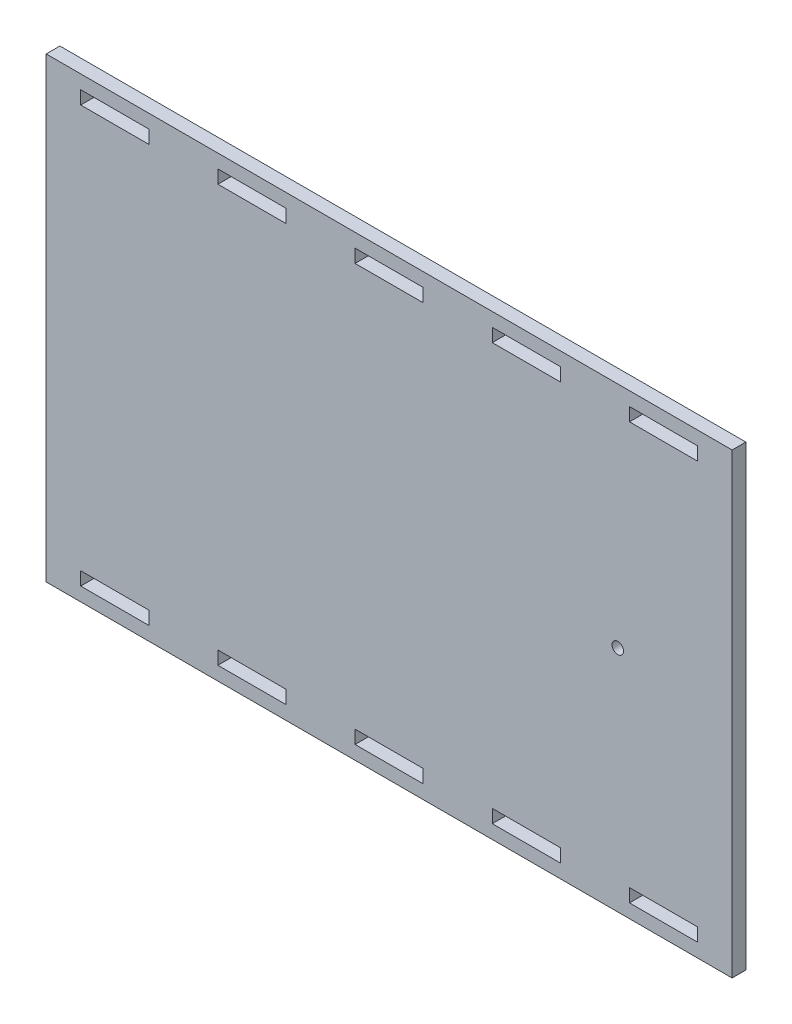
from build123d import *

# Parameters (mm, degrees)
SKETCH2_W           = 300
SKETCH2_H           = 200
BOSS_EXTRUDE1_DEPTH = 6
CUT_EXTRUDE1_REACH  = 182.377
SKETCH3_W           = 29.8
SKETCH3_H           = 5.8
CUT_EXTRUDE2_REACH  = 182.377
SKETCH4_R           = 2.5


with BuildPart() as part:
    # Sketch2 → Boss-Extrude1 (new body)
    with BuildSketch(Plane.XY):
        Rectangle(SKETCH2_W, SKETCH2_H)
    extrude(amount=BOSS_EXTRUDE1_DEPTH)

    # Sketch3 → Cut-Extrude1 (cut, up to next)
    with BuildSketch(Plane.XY.offset(6), mode=Mode.PRIVATE) as cut_extrude1_sk1:
        with Locations((-120, -91.1)):
            Rectangle(SKETCH3_W, SKETCH3_H)
    cut_extrude1_tool1 = extrude(cut_extrude1_sk1.sketch, amount=-CUT_EXTRUDE1_REACH, mode=Mode.PRIVATE) & part.part
    # Sketch3 → Cut-Extrude1 (cut, up to next)
    with BuildSketch(Plane.XY.offset(6), mode=Mode.PRIVATE) as cut_extrude1_sk2:
        with Locations((-60, -91.1)):
            Rectangle(SKETCH3_W, SKETCH3_H)
    cut_extrude1_tool2 = extrude(cut_extrude1_sk2.sketch, amount=-CUT_EXTRUDE1_REACH, mode=Mode.PRIVATE) & part.part
    # Sketch3 → Cut-Extrude1 (cut, up to next)
    with BuildSketch(Plane.XY.offset(6), mode=Mode.PRIVATE) as cut_extrude1_sk3:
        with Locations((0, -91.1)):
            Rectangle(SKETCH3_W, SKETCH3_H)
    cut_extrude1_tool3 = extrude(cut_extrude1_sk3.sketch, amount=-CUT_EXTRUDE1_REACH, mode=Mode.PRIVATE) & part.part
    # Sketch3 → Cut-Extrude1 (cut, up to next)
    with BuildSketch(Plane.XY.offset(6), mode=Mode.PRIVATE) as cut_extrude1_sk4:
        with Locations((60, -91.1)):
            Rectangle(SKETCH3_W, SKETCH3_H)
    cut_extrude1_tool4 = extrude(cut_extrude1_sk4.sketch, amount=-CUT_EXTRUDE1_REACH, mode=Mode.PRIVATE) & part.part
    # Sketch3 → Cut-Extrude1 (cut, up to next)
    with BuildSketch(Plane.XY.offset(6), mode=Mode.PRIVATE) as cut_extrude1_sk5:
        with Locations((120, -91.1)):
            Rectangle(SKETCH3_W, SKETCH3_H)
    cut_extrude1_tool5 = extrude(cut_extrude1_sk5.sketch, amount=-CUT_EXTRUDE1_REACH, mode=Mode.PRIVATE) & part.part
    # Sketch3 → Cut-Extrude1 (cut, up to next)
    with BuildSketch(Plane.XY.offset(6), mode=Mode.PRIVATE) as cut_extrude1_sk6:
        with Locations((120, 91.1)):
            Rectangle(SKETCH3_W, SKETCH3_H)
    cut_extrude1_tool6 = extrude(cut_extrude1_sk6.sketch, amount=-CUT_EXTRUDE1_REACH, mode=Mode.PRIVATE) & part.part
    # Sketch3 → Cut-Extrude1 (cut, up to next)
    with BuildSketch(Plane.XY.offset(6), mode=Mode.PRIVATE) as cut_extrude1_sk7:
        with Locations((60, 91.1)):
            Rectangle(SKETCH3_W, SKETCH3_H)
    cut_extrude1_tool7 = extrude(cut_extrude1_sk7.sketch, amount=-CUT_EXTRUDE1_REACH, mode=Mode.PRIVATE) & part.part
    # Sketch3 → Cut-Extrude1 (cut, up to next)
    with BuildSketch(Plane.XY.offset(6), mode=Mode.PRIVATE) as cut_extrude1_sk8:
        with Locations((0, 91.1)):
            Rectangle(SKETCH3_W, SKETCH3_H)
    cut_extrude1_tool8 = extrude(cut_extrude1_sk8.sketch, amount=-CUT_EXTRUDE1_REACH, mode=Mode.PRIVATE) & part.part
    # Sketch3 → Cut-Extrude1 (cut, up to next)
    with BuildSketch(Plane.XY.offset(6), mode=Mode.PRIVATE) as cut_extrude1_sk9:
        with Locations((-60, 91.1)):
            Rectangle(SKETCH3_W, SKETCH3_H)
    cut_extrude1_tool9 = extrude(cut_extrude1_sk9.sketch, amount=-CUT_EXTRUDE1_REACH, mode=Mode.PRIVATE) & part.part
    # Sketch3 → Cut-Extrude1 (cut, up to next)
    with BuildSketch(Plane.XY.offset(6), mode=Mode.PRIVATE) as cut_extrude1_sk10:
        with Locations((-120, 91.1)):
            Rectangle(SKETCH3_W, SKETCH3_H)
    cut_extrude1_tool10 = extrude(cut_extrude1_sk10.sketch, amount=-CUT_EXTRUDE1_REACH, mode=Mode.PRIVATE) & part.part
    add(cut_extrude1_tool1.solids().sort_by_distance((-120, -91.1, 6))[0], mode=Mode.SUBTRACT)
    add(cut_extrude1_tool2.solids().sort_by_distance((-60, -91.1, 6))[0], mode=Mode.SUBTRACT)
    add(cut_extrude1_tool3.solids().sort_by_distance((0, -91.1, 6))[0], mode=Mode.SUBTRACT)
    add(cut_extrude1_tool4.solids().sort_by_distance((60, -91.1, 6))[0], mode=Mode.SUBTRACT)
    add(cut_extrude1_tool5.solids().sort_by_distance((120, -91.1, 6))[0], mode=Mode.SUBTRACT)
    add(cut_extrude1_tool6.solids().sort_by_distance((120, 91.1, 6))[0], mode=Mode.SUBTRACT)
    add(cut_extrude1_tool7.solids().sort_by_distance((60, 91.1, 6))[0], mode=Mode.SUBTRACT)
    add(cut_extrude1_tool8.solids().sort_by_distance((0, 91.1, 6))[0], mode=Mode.SUBTRACT)
    add(cut_extrude1_tool9.solids().sort_by_distance((-60, 91.1, 6))[0], mode=Mode.SUBTRACT)
    add(cut_extrude1_tool10.solids().sort_by_distance((-120, 91.1, 6))[0], mode=Mode.SUBTRACT)

    # Sketch4 → Cut-Extrude2 (cut, up to next)
    with BuildSketch(Plane.XY.offset(6), mode=Mode.PRIVATE) as cut_extrude2_sk1:
        with Locations((100, 0)):
            Circle(SKETCH4_R)
    cut_extrude2_tool1 = extrude(cut_extrude2_sk1.sketch, amount=-CUT_EXTRUDE2_REACH, mode=Mode.PRIVATE) & part.part
    add(cut_extrude2_tool1.solids().sort_by_distance((100, 0, 6))[0], mode=Mode.SUBTRACT)


solid = part.part
